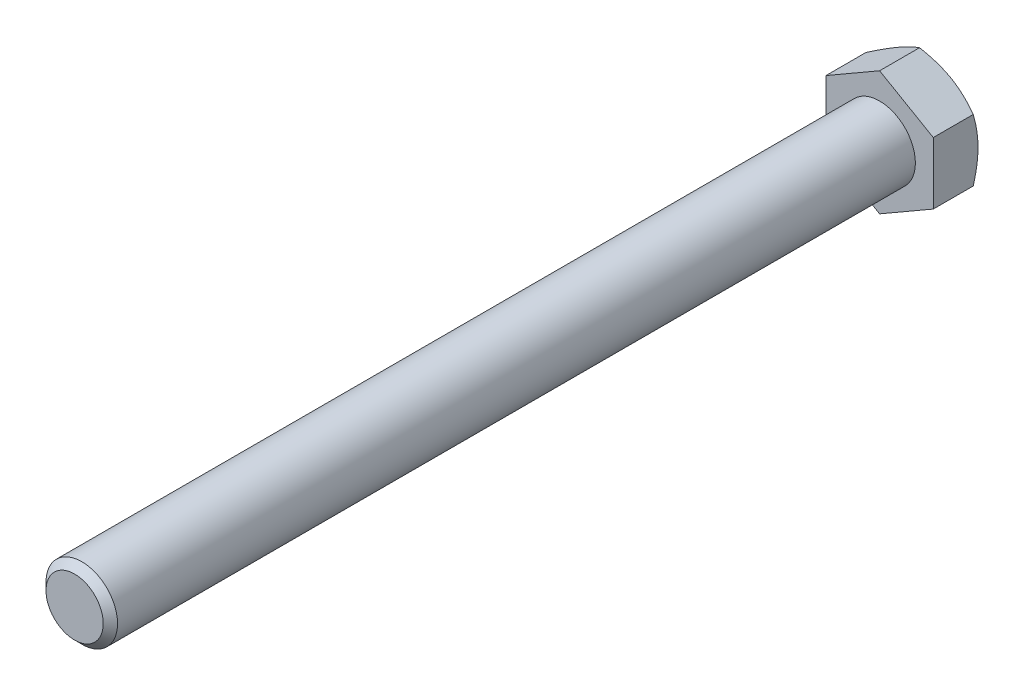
from build123d import *
from build123d.topology import SkipClean

# Parameters (mm, degrees)
CHANFREIN1_SIZE    = 1.6
BOSS_EXTRU_1_DEPTH = 10


with BuildPart() as part:
    # Esquisse1 → Base-R_volution (revolve)
    with BuildSketch(Plane(origin=(0, 0, 0), x_dir=(1, 0, 0), z_dir=(0, 1, 0))):
        Polygon((0, 0), (8, 0), (8.000000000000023, -179.99999999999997), (2.204e-14, -180), align=None)
    revolve(axis=Axis((0, 0, 0), (1.2e-16, 0, 1)))

    # Chanfrein1
    chanfrein1_edges = [part.edges().sort_by_distance(p)[0] for p in [
        (-7.99999999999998, 9.8e-16, 179.99999999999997),
    ]]
    chamfer(chanfrein1_edges, length=CHANFREIN1_SIZE)

    # Enl_vement de mati_re-Balayage3: sweep along a curve in space
    with SkipClean():  # the faces are left unmerged after this step: merging them gives an invalid solid
        with BuildLine() as enl_vement_de_mati_re_balayage3_path:
            add(Edge.make_bspline(
                [(8.000000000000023, 0, 180), (8.000000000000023, -1.0404923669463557, 179.95860012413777), (7.583454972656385, -3.1442163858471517, 179.87487618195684), (5.804125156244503, -5.803308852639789, 179.7500331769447), (3.141169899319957, -7.583673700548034, 179.6249911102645), (-9.94e-15, -8.20821390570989, 179.5000023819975), (-3.141169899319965, -7.5834706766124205, 179.37499936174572), (-5.804125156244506, -5.804120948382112, 179.25000017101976), (-7.5834549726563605, -3.141171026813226, 179.1249999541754), (-8.2082725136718, 3.021109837e-07, 179.0000000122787), (-7.583454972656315, 3.1411698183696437, 178.87499999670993), (-5.804125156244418, 5.8041251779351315, 178.7500000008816), (-3.141169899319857, 7.58345496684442, 178.62499999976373), (1.1731e-13, 8.208272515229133, 178.5000000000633), (3.1411698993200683, 7.583454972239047, 178.37499999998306), (5.804125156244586, 5.804125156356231, 178.25000000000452), (7.5834549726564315, 3.141169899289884, 178.1249999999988), (8.208272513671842, 7.91195e-12, 178.00000000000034), (7.583454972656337, -3.1411698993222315, 177.87499999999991), (5.804125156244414, -5.804125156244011, 177.75), (3.14116989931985, -7.583454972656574, 177.62500000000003), (-1.3526e-13, -8.208272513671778, 177.5), (-3.1411698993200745, -7.583454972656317, 177.37500000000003), (-5.804125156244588, -5.804125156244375, 177.25000000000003), (-7.583454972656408, -3.141169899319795, 177.12499999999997), (-8.208272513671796, 1.9226e-13, 176.99999999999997), (-7.583454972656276, 3.1411698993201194, 176.875), (-5.804125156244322, 5.80412515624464, 176.74999999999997), (-3.141169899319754, 7.583454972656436, 176.625), (2.334e-13, 8.208272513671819, 176.49999999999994), (3.1411698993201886, 7.583454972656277, 176.37500000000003), (5.804125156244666, 5.8041251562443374, 176.25), (7.583454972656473, 3.1411698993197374, 176.12499999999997), (8.208272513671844, -2.5152e-13, 176), (7.583454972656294, -3.1411698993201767, 175.87500000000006), (5.8041251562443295, -5.804125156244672, 175.74999999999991), (3.1411698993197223, -7.583454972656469, 175.62500000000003), (-2.4089e-13, -8.20827251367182, 175.5), (-3.141169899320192, -7.583454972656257, 175.37499999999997), (-5.804125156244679, -5.80412515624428, 175.24999999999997), (-7.583454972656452, -3.1411698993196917, 175.12500000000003), (-8.208272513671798, 3.0225e-13, 174.99999999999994), (-7.583454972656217, 3.1411698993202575, 174.87500000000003), (-5.804125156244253, 5.80412515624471, 174.75), (-3.141169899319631, 7.583454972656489, 174.625), (3.5419e-13, 8.208272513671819, 174.49999999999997), (3.1411698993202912, 7.583454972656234, 174.375), (5.804125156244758, 5.804125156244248, 174.25), (7.583454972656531, 3.141169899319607, 174.12500000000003), (8.208272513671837, -3.4129e-13, 174), (7.583454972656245, -3.1411698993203, 173.875), (5.804125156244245, -5.804125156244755, 173.75), (3.1411698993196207, -7.58345497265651, 173.62499999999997), (-3.7058e-13, -8.208272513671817, 173.49999999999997), (-3.141169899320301, -7.583454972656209, 173.37500000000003), (-5.804125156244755, -5.804125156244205, 173.25), (-7.583454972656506, -3.141169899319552, 173.125), (-8.20827251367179, 4.0021e-13, 173), (-7.583454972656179, 3.141169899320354, 172.875), (-5.804125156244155, 5.804125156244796, 172.74999999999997), (-3.14116989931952, 7.58345497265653, 172.625), (4.7394e-13, 8.208272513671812, 172.49999999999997), (3.141169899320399, 7.583454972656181, 172.375), (5.8041251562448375, 5.804125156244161, 172.25), (7.58345497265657, 3.1411698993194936, 172.12500000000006), (8.208272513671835, -4.6087e-13, 171.99999999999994), (7.583454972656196, -3.1411698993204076, 171.87500000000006), (5.804125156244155, -5.804125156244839, 171.74999999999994), (3.1411698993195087, -7.583454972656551, 171.62500000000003), (-4.9032e-13, -8.208272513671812, 171.49999999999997), (-3.141169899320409, -7.583454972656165, 171.375), (-5.804125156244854, -5.804125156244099, 171.24999999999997), (-7.583454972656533, -3.141169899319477, 171.125), (-8.208272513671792, 5.4453e-13, 170.99999999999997), (-7.583454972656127, 3.14116989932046, 170.875), (-5.804125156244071, 5.804125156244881, 170.74999999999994), (-3.1411698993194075, 7.5834549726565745, 170.625), (5.9491e-13, 8.20827251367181, 170.49999999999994), (3.1411698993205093, 7.58345497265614, 170.37500000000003), (5.804125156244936, 5.804125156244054, 170.25), (7.583454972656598, 3.1411698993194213, 170.125), (8.208272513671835, -6.0502e-13, 170), (7.583454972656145, -3.1411698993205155, 169.875), (5.804125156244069, -5.804125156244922, 169.74999999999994), (3.141169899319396, -7.583454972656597, 169.625), (-6.1182e-13, -8.208272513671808, 169.49999999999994), (-3.1411698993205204, -7.583454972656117, 169.37500000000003), (-5.804125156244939, -5.8041251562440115, 169.24999999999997), (-7.583454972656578, -3.141169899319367, 169.125), (-8.208272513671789, 6.6847e-13, 168.99999999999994), (-7.58345497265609, 3.14116989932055, 168.87499999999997), (-5.804125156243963, 5.8041251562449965, 168.74999999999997), (-3.1411698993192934, 7.583454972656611, 168.62499999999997), (6.716e-13, 8.208272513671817, 168.49999999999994), (3.1411698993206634, 7.583454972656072, 168.375), (5.804125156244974, 5.804125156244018, 168.24999999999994), (7.583454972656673, 3.1411698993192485, 168.125), (8.20827251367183, -6.7579e-13, 167.99999999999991), (7.583454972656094, -3.1411698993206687, 167.87500000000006), (5.8041251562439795, -5.804125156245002, 167.74999999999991), (3.141169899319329, -7.583454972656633, 167.62500000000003), (-7.7723e-13, -8.208272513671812, 167.49999999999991), (-3.1411698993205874, -7.583454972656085, 167.37500000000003), (-5.804125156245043, -5.80412515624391, 167.24999999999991), (-7.5834549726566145, -3.141169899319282, 167.12500000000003), (-8.208272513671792, 8.2918e-13, 166.99999999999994), (-7.5834549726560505, 3.1411698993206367, 166.87499999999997), (-5.804125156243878, 5.804125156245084, 166.75), (-3.1411698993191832, 7.583454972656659, 166.62499999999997), (7.9153e-13, 8.208272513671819, 166.5), (3.1411698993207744, 7.5834549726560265, 166.375), (5.8041251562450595, 5.804125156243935, 166.24999999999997), (7.583454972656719, 3.1411698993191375, 166.12500000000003), (8.208272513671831, -7.9501e-13, 165.99999999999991), (7.583454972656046, -3.141169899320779, 165.87500000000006), (5.804125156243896, -5.804125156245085, 165.74999999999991), (3.1411698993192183, -7.583454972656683, 165.625), (-8.975e-13, -8.20827251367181, 165.5), (-3.141169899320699, -7.583454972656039, 165.375), (-5.804125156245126, -5.804125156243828, 165.24999999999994), (-7.58345497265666, -3.141169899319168, 165.125), (-8.2082725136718, 9.4335e-13, 164.99999999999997), (-7.583454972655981, 3.1411698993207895, 164.875), (-5.8041251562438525, 5.804125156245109, 164.74999999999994), (-3.141169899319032, 7.58345497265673, 164.625), (9.0605e-13, 8.20827251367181, 164.49999999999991), (3.1411698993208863, 7.583454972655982, 164.37500000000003), (5.804125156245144, 5.804125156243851, 164.24999999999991), (7.583454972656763, 3.1411698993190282, 164.12500000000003), (8.20827251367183, -9.1406e-13, 163.99999999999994), (7.583454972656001, -3.141169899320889, 163.87500000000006), (5.804125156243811, -5.804125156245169, 163.74999999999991), (3.1411698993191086, -7.583454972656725, 163.62500000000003), (-1.01534e-12, -8.20827251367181, 163.49999999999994), (-3.141169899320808, -7.583454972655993, 163.375), (-5.80412515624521, -5.804125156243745, 163.24999999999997), (-7.583454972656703, -3.1411698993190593, 163.12499999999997), (-8.208272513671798, 1.06083e-12, 162.99999999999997), (-7.583454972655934, 3.1411698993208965, 162.875), (-5.804125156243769, 5.804125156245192, 162.74999999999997), (-3.141169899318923, 7.583454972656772, 162.625), (1.02301e-12, 8.208272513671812, 162.49999999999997), (3.1411698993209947, 7.583454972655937, 162.375), (5.8041251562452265, 5.804125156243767, 162.24999999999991), (7.583454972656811, 3.1411698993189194, 162.125), (8.20827251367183, -1.03207e-12, 161.99999999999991), (7.583454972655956, -3.141169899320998, 161.87500000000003), (5.804125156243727, -5.804125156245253, 161.74999999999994), (3.141169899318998, -7.583454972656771, 161.625), (-1.13404e-12, -8.20827251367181, 161.49999999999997), (-3.1411698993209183, -7.583454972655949, 161.375), (-5.804125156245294, -5.80412515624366, 161.24999999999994), (-7.5834549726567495, -3.141169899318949, 161.12499999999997), (-8.2082725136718, 1.18093e-12, 161.00000000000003), (-7.583454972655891, 3.141169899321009, 160.87499999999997), (-5.804125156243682, 5.804125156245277, 160.74999999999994), (-3.1411698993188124, 7.583454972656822, 160.625), (1.14328e-12, 8.208272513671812, 160.49999999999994), (3.141169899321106, 7.5834549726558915, 160.375), (5.804125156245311, 5.80412515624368, 160.24999999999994), (7.58345497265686, 3.141169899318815, 160.12500000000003), (8.208272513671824, -1.19906e-12, 159.99999999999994), (7.58345497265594, -3.1411698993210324, 159.87500000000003), (5.804125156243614, -5.804125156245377, 159.74999999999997), (3.1411698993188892, -7.583454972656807, 159.625), (-1.2564e-12, -8.208272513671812, 159.49999999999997), (-3.1411698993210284, -7.583454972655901, 159.37499999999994), (-5.804125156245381, -5.804125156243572, 159.24999999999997), (-7.583454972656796, -3.1411698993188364, 159.12499999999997), (-8.208272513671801, 1.30225e-12, 158.99999999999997), (-7.583454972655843, 3.1411698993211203, 158.87499999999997), (-5.8041251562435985, 5.804125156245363, 158.74999999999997), (-3.1411698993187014, 7.583454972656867, 158.625), (1.26477e-12, 8.208272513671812, 158.49999999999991), (3.1411698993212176, 7.5834549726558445, 158.37500000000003), (5.804125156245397, 5.804125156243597, 158.24999999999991), (7.583454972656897, 3.1411698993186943, 158.12500000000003), (8.208272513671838, -1.26808e-12, 157.99999999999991), (7.583454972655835, -3.1411698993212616, 157.875), (5.80412515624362, -5.804125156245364, 157.74999999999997), (3.1411698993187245, -7.583454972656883, 157.625), (-1.31898e-12, -8.208272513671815, 157.49999999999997), (-3.1411698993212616, -7.583454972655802, 157.375), (-5.804125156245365, -5.80412515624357, 157.24999999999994), (-7.583454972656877, -3.1411698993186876, 157.125), (-8.208272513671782, 1.46522e-12, 156.99999999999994), (-7.583454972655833, 3.141169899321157, 156.875), (-5.804125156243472, 5.804125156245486, 156.74999999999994), (-3.1411698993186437, 7.583454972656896, 156.625), (1.51891e-12, 8.208272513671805, 156.49999999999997), (3.1411698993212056, 7.583454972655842, 156.375), (5.8041251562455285, 5.804125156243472, 156.24999999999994), (7.583454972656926, 3.141169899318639, 156.125), (8.20827251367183, -1.52623e-12, 155.99999999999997), (7.583454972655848, -3.141169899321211, 155.875), (5.804125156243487, -5.804125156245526, 155.74999999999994), (3.1411698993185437, -7.583454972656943, 155.625), (-1.36482e-12, -8.208272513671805, 155.49999999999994), (-3.141169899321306, -7.583454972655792, 155.375), (-5.804125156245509, -5.8041251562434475, 155.24999999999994), (-7.583454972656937, -3.1411698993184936, 155.12499999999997), (-8.208272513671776, 1.41694e-12, 154.99999999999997), (-7.583454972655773, 3.1411698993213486, 154.87499999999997), (-5.804125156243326, 5.8041251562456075, 154.74999999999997), (-3.1411698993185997, 7.583454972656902, 154.62499999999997), (1.56161e-12, 8.20827251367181, 154.49999999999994), (3.1411698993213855, 7.583454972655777, 154.37499999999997), (5.804125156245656, 5.80412515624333, 154.24999999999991), (7.583454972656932, 3.141169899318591, 154.125), (8.208272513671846, -1.55917e-12, 153.99999999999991), (7.583454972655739, -3.141169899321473, 153.87500000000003), (5.804125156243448, -5.804125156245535, 153.74999999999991), (3.141169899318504, -7.583454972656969, 153.625), (-1.55621e-12, -8.208272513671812, 153.49999999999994), (-3.1411698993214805, -7.583454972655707, 153.37499999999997), (-5.804125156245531, -5.804125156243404, 153.24999999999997), (-7.583454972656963, -3.1411698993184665, 153.12499999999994), (-8.208272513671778, 1.70123e-12, 152.99999999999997), (-7.5834549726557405, 3.1411698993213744, 152.875), (-5.804125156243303, 5.80412515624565, 152.74999999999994), (-3.1411698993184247, 7.583454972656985, 152.62499999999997), (1.75579e-12, 8.208272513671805, 152.49999999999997), (3.1411698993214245, 7.583454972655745, 152.37499999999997), (5.804125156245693, 5.804125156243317, 152.24999999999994), (7.583454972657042, 3.141169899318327, 152.125), (8.208272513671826, -1.59525e-12, 151.99999999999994), (7.583454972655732, -3.1411698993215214, 151.87499999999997), (5.80412515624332, -5.8041251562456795, 151.74999999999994), (3.1411698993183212, -7.583454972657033, 151.62499999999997), (-1.6024e-12, -8.208272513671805, 151.49999999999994), (-3.141169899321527, -7.583454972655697, 151.37499999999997), (-5.804125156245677, -5.804125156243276, 151.24999999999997), (-7.583454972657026, -3.141169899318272, 151.12499999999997), (-8.208272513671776, 1.65626e-12, 150.99999999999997), (-7.583454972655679, 3.1411698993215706, 150.87499999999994), (-5.80412515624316, 5.804125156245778, 150.74999999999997), (-3.141169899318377, 7.583454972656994, 150.62499999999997), (1.80129e-12, 8.208272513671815, 150.49999999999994), (3.141169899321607, 7.5834549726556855, 150.375), (5.804125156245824, 5.8041251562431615, 150.24999999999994), (7.583454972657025, 3.14116989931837, 150.12499999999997), (8.208272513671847, -1.79884e-12, 149.99999999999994), (7.583454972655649, -3.1411698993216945, 149.87499999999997), (5.804125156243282, -5.804125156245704, 149.74999999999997), (3.141169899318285, -7.583454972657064, 149.62499999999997), (-1.79518e-12, -8.208272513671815, 149.49999999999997), (-3.141169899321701, -7.583454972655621, 149.375), (-5.804125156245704, -5.804125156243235, 149.24999999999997), (-7.583454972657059, -3.1411698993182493, 149.12499999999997), (-8.208272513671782, 1.94108e-12, 148.99999999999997), (-7.583454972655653, 3.1411698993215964, 148.875), (-5.804125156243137, 5.804125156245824, 148.74999999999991), (-3.141169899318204, 7.58345497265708, 148.62500000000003), (1.99564e-12, 8.20827251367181, 148.49999999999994), (3.141169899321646, 7.583454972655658, 148.375), (5.804125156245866, 5.804125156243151, 148.24999999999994), (7.583454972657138, 3.1411698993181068, 148.125), (8.208272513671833, -1.83562e-12, 147.99999999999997), (7.583454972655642, -3.1411698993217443, 147.87499999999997), (5.8041251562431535, -5.804125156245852, 147.74999999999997), (3.141169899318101, -7.5834549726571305, 147.62499999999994), (-1.84486e-12, -8.208272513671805, 147.49999999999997), (-3.1411698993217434, -7.583454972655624, 147.37499999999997), (-5.804125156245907, -5.804125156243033, 147.24999999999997), (-7.583454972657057, -3.1411698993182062, 147.12499999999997), (-8.208272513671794, 1.9911e-12, 146.99999999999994), (-7.583454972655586, 3.141169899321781, 146.87499999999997), (-5.804125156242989, 5.804125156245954, 146.74999999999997), (-3.1411698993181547, 7.58345497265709, 146.62499999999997), (2.0434e-12, 8.208272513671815, 146.49999999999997), (3.141169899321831, 7.583454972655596, 146.37499999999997), (5.804125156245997, 5.804125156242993, 146.24999999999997), (7.58345497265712, 3.1411698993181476, 146.125), (8.208272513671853, -2.04026e-12, 145.99999999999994), (7.583454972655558, -3.1411698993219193, 145.875), (5.804125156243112, -5.804125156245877, 145.74999999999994), (3.141169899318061, -7.583454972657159, 145.62499999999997), (-2.03799e-12, -8.208272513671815, 145.49999999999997), (-3.141169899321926, -7.58345497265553, 145.37499999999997), (-5.804125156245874, -5.804125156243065, 145.24999999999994), (-7.5834549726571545, -3.1411698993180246, 145.12499999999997), (-8.208272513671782, 2.18337e-12, 144.99999999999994), (-7.583454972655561, 3.1411698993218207, 144.87499999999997), (-5.804125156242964, 5.804125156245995, 144.74999999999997), (-3.1411698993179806, 7.583454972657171, 144.62499999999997), (2.23792e-12, 8.20827251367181, 144.49999999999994), (3.141169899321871, 7.583454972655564, 144.375), (5.804125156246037, 5.80412515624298, 144.24999999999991), (7.583454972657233, 3.141169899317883, 144.125), (8.208272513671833, -2.07808e-12, 143.99999999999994), (7.5834549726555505, -3.1411698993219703, 143.875), (5.80412515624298, -5.804125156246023, 143.74999999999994), (3.141169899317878, -7.583454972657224, 143.62499999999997), (-2.08732e-12, -8.208272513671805, 143.49999999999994), (-3.1411698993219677, -7.583454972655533, 143.37499999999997), (-5.804125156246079, -5.804125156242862, 143.24999999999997), (-7.583454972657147, -3.1411698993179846, 143.12499999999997), (-8.208272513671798, 2.23287e-12, 142.99999999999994), (-7.583454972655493, 3.1411698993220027, 142.87499999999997), (-5.804125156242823, 5.804125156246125, 142.74999999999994), (-3.14116989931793, 7.583454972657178, 142.62499999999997), (2.27313e-12, 8.208272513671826, 142.49999999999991), (3.141169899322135, 7.583454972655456, 142.37499999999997), (5.804125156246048, 5.80412515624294, 142.24999999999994), (7.583454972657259, 3.1411698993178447, 142.12499999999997), (8.208272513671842, -2.27034e-12, 141.99999999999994), (7.583454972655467, -3.141169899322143, 141.87499999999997), (5.80412515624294, -5.804125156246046, 141.74999999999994), (3.141169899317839, -7.58345497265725, 141.625), (-2.27836e-12, -8.208272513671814, 141.49999999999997), (-3.1411698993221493, -7.583454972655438, 141.37499999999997), (-5.804125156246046, -5.804125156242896, 141.24999999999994), (-7.583454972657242, -3.141169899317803, 141.12499999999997), (-8.208272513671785, 2.42217e-12, 140.99999999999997), (-7.583454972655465, 3.1411698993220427, 140.87499999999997), (-5.804125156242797, 5.804125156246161, 140.74999999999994), (-3.141169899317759, 7.583454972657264, 140.62499999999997), (2.47533e-12, 8.208272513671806, 140.49999999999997), (3.141169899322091, 7.583454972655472, 140.37499999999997), (5.804125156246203, 5.804125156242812, 140.24999999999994), (7.5834549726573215, 3.141169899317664, 140.125), (8.208272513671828, -2.3141e-12, 139.99999999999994), (7.583454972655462, -3.141169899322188, 139.87499999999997), (5.804125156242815, -5.804125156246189, 139.74999999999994), (3.14116989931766, -7.5834549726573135, 139.625), (-2.32264e-12, -8.208272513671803, 139.49999999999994), (-3.141169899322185, -7.583454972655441, 139.37499999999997), (-5.804125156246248, -5.804125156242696, 139.24999999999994), (-7.58345497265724, -3.1411698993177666, 139.12499999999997), (-8.208272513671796, 2.46853e-12, 138.99999999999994), (-7.583454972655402, 3.1411698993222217, 138.875), (-5.804125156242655, 5.80412515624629, 138.74999999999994), (-3.1411698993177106, 7.583454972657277, 138.62499999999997), (2.5088e-12, 8.208272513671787, 138.49999999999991), (3.1411698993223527, 7.5834549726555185, 138.375), (5.804125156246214, 5.804125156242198, 138.24999999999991), (7.58345497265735, 3.1411698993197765, 138.12500000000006), (8.20827251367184, -1.05337e-11, 137.99999999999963), (7.583454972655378, -3.141169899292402, 137.87500000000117), (5.804125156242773, -5.804125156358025, 137.7499999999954), (3.1411698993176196, -7.583454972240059, 137.62500000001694), (-2.5149e-12, -8.208272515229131, 137.49999999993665), (-3.1411698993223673, -7.5834549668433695, 137.37500000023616), (-5.8041251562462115, -5.804125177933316, 137.2499999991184), (-7.583454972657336, -3.1411698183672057, 137.12500000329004), (-8.208272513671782, -3.0210826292e-07, 136.99999998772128), (-7.583454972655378, 3.1411710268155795, 136.87500004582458), (-5.804125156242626, 5.804120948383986, 136.7499998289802), (-3.1411698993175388, 7.583470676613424, 136.62500063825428), (2.715e-12, 8.208213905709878, 136.49999761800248), (3.1411698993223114, 7.5836737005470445, 136.37500888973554), (5.804125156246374, 5.803308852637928, 136.24996682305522), (7.583454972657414, 3.1442163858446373, 136.12512381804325), (8.000000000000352, 1.0404923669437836, 136.04139987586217), (8.000000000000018, -2.57216e-12, 135.99999999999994)],
                knots=[0, 0, 0, 0, 0.00284090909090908, 0.00568181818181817, 0.00852272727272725, 0.01136363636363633, 0.01420454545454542, 0.0170454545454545, 0.01988636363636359, 0.02272727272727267, 0.02556818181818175, 0.02840909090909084, 0.03124999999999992, 0.03409090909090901, 0.03693181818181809, 0.03977272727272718, 0.04261363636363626, 0.04545454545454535, 0.04829545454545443, 0.05113636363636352, 0.05397727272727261, 0.05681818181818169, 0.05965909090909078, 0.06249999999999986, 0.06534090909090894, 0.06818181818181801, 0.0710227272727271, 0.07386363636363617, 0.07670454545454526, 0.07954545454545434, 0.08238636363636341, 0.0852272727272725, 0.08806818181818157, 0.09090909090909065, 0.09374999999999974, 0.09659090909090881, 0.09943181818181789, 0.10227272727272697, 0.10511363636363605, 0.10795454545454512, 0.11079545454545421, 0.11363636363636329, 0.11647727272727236, 0.11931818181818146, 0.12215909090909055, 0.12499999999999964, 0.12784090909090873, 0.13068181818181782, 0.1335227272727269, 0.13636363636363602, 0.1392045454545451, 0.1420454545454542, 0.14488636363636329, 0.14772727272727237, 0.15056818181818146, 0.15340909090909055, 0.15624999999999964, 0.15909090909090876, 0.16193181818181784, 0.16477272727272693, 0.16761363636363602, 0.1704545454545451, 0.1732954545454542, 0.17613636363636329, 0.17897727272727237, 0.1818181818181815, 0.18465909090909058, 0.18749999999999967, 0.19034090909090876, 0.19318181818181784, 0.19602272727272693, 0.19886363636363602, 0.20170454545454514, 0.20454545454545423, 0.2073863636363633, 0.2102272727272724, 0.2130681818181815, 0.21590909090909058, 0.21874999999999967, 0.22159090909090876, 0.22443181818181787, 0.22727272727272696, 0.23011363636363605, 0.23295454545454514, 0.23579545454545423, 0.2386363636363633, 0.2414772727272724, 0.2443181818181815, 0.2471590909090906, 0.2499999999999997, 0.2528409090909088, 0.25568181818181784, 0.25852272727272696, 0.2613636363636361, 0.26420454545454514, 0.26704545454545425, 0.2698863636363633, 0.27272727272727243, 0.2755681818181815, 0.2784090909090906, 0.2812499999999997, 0.2840909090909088, 0.2869318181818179, 0.28977272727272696, 0.2926136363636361, 0.29545454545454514, 0.29829545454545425, 0.3011363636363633, 0.30397727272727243, 0.30681818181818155, 0.3096590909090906, 0.3124999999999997, 0.3153409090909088, 0.3181818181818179, 0.32102272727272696, 0.3238636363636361, 0.3267045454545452, 0.32954545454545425, 0.33238636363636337, 0.33522727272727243, 0.33806818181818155, 0.3409090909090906, 0.3437499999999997, 0.34659090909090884, 0.3494318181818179, 0.352272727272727, 0.3551136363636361, 0.3579545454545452, 0.36079545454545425, 0.36363636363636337, 0.36647727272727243, 0.36931818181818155, 0.37215909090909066, 0.3749999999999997, 0.37784090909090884, 0.3806818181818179, 0.383522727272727, 0.3863636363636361, 0.3892045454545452, 0.3920454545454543, 0.39488636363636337, 0.3977272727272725, 0.40056818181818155, 0.40340909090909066, 0.4062499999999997, 0.40909090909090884, 0.4119318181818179, 0.414772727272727, 0.41761363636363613, 0.4204545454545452, 0.4232954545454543, 0.42613636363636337, 0.4289772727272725, 0.43181818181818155, 0.43465909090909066, 0.4374999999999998, 0.44034090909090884, 0.44318181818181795, 0.446022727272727, 0.44886363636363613, 0.4517045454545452, 0.4545454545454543, 0.4573863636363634, 0.4602272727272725, 0.4630681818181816, 0.46590909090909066, 0.4687499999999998, 0.47159090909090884, 0.47443181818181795, 0.477272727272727, 0.48011363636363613, 0.48295454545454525, 0.4857954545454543, 0.4886363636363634, 0.4914772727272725, 0.4943181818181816, 0.49715909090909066, 0.4999999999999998, 0.5028409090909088, 0.505681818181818, 0.5085227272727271, 0.5113636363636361, 0.5142045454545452, 0.5170454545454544, 0.5198863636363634, 0.5227272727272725, 0.5255681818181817, 0.5284090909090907, 0.5312499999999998, 0.5340909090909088, 0.536931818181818, 0.5397727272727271, 0.5426136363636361, 0.5454545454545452, 0.5482954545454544, 0.5511363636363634, 0.5539772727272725, 0.5568181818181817, 0.5596590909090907, 0.5624999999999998, 0.5653409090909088, 0.568181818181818, 0.5710227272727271, 0.5738636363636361, 0.5767045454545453, 0.5795454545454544, 0.5823863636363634, 0.5852272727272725, 0.5880681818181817, 0.5909090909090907, 0.5937499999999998, 0.596590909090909, 0.599431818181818, 0.6022727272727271, 0.6051136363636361, 0.6079545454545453, 0.6107954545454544, 0.6136363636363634, 0.6164772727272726, 0.6193181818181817, 0.6221590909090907, 0.6249999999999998, 0.627840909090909, 0.630681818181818, 0.6335227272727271, 0.6363636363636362, 0.6392045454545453, 0.6420454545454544, 0.6448863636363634, 0.6477272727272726, 0.6505681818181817, 0.6534090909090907, 0.6562499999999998, 0.659090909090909, 0.661931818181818, 0.6647727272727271, 0.6676136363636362, 0.6704545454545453, 0.6732954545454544, 0.6761363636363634, 0.6789772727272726, 0.6818181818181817, 0.6846590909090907, 0.6874999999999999, 0.690340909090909, 0.693181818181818, 0.6960227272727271, 0.6988636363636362, 0.7017045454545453, 0.7045454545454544, 0.7073863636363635, 0.7102272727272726, 0.7130681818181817, 0.7159090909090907, 0.7187499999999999, 0.721590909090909, 0.724431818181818, 0.7272727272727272, 0.7301136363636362, 0.7329545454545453, 0.7357954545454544, 0.7386363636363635, 0.7414772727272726, 0.7443181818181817, 0.7471590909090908, 0.7499999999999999, 0.752840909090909, 0.755681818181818, 0.7585227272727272, 0.7613636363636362, 0.7642045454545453, 0.7670454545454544, 0.7698863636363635, 0.7727272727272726, 0.7755681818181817, 0.7784090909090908, 0.7812499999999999, 0.784090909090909, 0.786931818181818, 0.7897727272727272, 0.7926136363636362, 0.7954545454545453, 0.7982954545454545, 0.8011363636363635, 0.8039772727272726, 0.8068181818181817, 0.8096590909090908, 0.8124999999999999, 0.815340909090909, 0.8181818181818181, 0.8210227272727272, 0.8238636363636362, 0.8267045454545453, 0.8295454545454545, 0.8323863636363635, 0.8352272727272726, 0.8380681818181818, 0.8409090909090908, 0.8437499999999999, 0.846590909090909, 0.8494318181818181, 0.8522727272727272, 0.8551136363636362, 0.8579545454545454, 0.8607954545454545, 0.8636363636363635, 0.8664772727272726, 0.8693181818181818, 0.8721590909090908, 0.8749999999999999, 0.877840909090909, 0.8806818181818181, 0.8835227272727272, 0.8863636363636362, 0.8892045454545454, 0.8920454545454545, 0.8948863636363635, 0.8977272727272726, 0.9005681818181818, 0.9034090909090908, 0.9062499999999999, 0.9090909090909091, 0.9119318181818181, 0.9147727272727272, 0.9176136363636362, 0.9204545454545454, 0.9232954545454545, 0.9261363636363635, 0.9289772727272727, 0.9318181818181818, 0.9346590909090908, 0.9374999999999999, 0.9403409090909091, 0.9431818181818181, 0.9460227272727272, 0.9488636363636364, 0.9517045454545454, 0.9545454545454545, 0.9573863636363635, 0.9602272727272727, 0.9630681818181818, 0.9659090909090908, 0.9687499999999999, 0.9715909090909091, 0.9744318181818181, 0.9772727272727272, 0.9801136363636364, 0.9829545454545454, 0.9857954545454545, 0.9886363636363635, 0.9914772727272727, 0.9943181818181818, 0.9971590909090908, 1, 1, 1, 1], degree=3))
        # Esquisse3 → Enl_vement de mati_re-Balayage3 (sweep, cut)
        with BuildSketch(Plane(origin=(0, 0, 0), x_dir=(1, 0, 0), z_dir=(0, 1, 0))):
            Polygon((6.800000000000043, -180), (6.800000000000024, -179.88), (8.120000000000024, -179.11789764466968), (8.120000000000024, -180.88210235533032), (6.800000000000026, -180.12), align=None)
        sweep(path=enl_vement_de_mati_re_balayage3_path.line, is_frenet=True, mode=Mode.SUBTRACT)

    # Esquisse6 → Boss.-Extru.1 (add)
    with BuildSketch(Plane.XY):
        Polygon((12.000000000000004, -6.928203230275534), (12.000000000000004, 6.928203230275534), (-6.072e-14, 13.856406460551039), (-12.000000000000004, 6.928203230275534), (-12.000000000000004, -6.928203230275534), (-6.072e-14, -13.856406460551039), align=None)
    extrude(amount=-BOSS_EXTRU_1_DEPTH)

    # Esquisse7 → Enl_vement de mati_re-R_volution1 (revolve, cut)
    with BuildSketch(Plane(origin=(0, 0, 0), x_dir=(1, 0, 0), z_dir=(0, 1, 0))):
        Polygon((-12.000000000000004, 10), (-29.320508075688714, 9.999999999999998), (-29.320508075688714, 0), align=None)
    revolve(axis=Axis((-7.6e-16, 0, -6.239446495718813), (1.2e-16, 0, 1)), mode=Mode.SUBTRACT)


solid = part.part
